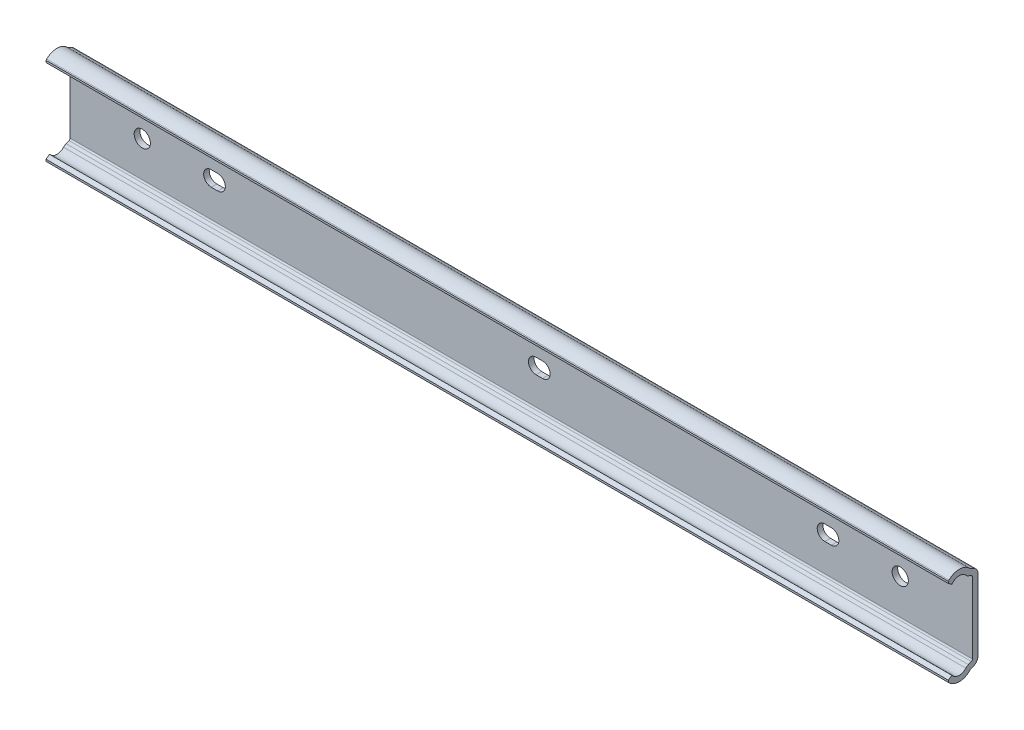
ISO-10303-21;
HEADER;
FILE_DESCRIPTION(('STEP AP214'),'2;1');
FILE_NAME('part.step','',(''),(''),'','','');
FILE_SCHEMA(('AUTOMOTIVE_DESIGN { 1 0 10303 214 1 1 1 1 }'));
ENDSEC;
DATA;
#1=APPLICATION_CONTEXT('core data for automotive mechanical design processes');
#2=APPLICATION_PROTOCOL_DEFINITION('international standard','automotive_design',2000,#1);
#3=PRODUCT_CONTEXT('',#1,'mechanical');
#4=PRODUCT('Part','Part','',(#3));
#5=PRODUCT_RELATED_PRODUCT_CATEGORY('part','',(#4));
#6=PRODUCT_DEFINITION_FORMATION('','',#4);
#7=PRODUCT_DEFINITION_CONTEXT('part definition',#1,'design');
#8=PRODUCT_DEFINITION('design','',#6,#7);
#9=PRODUCT_DEFINITION_SHAPE('','',#8);
#10=(LENGTH_UNIT() NAMED_UNIT(*) SI_UNIT(.MILLI.,.METRE.));
#11=(NAMED_UNIT(*) PLANE_ANGLE_UNIT() SI_UNIT($,.RADIAN.));
#12=(NAMED_UNIT(*) SI_UNIT($,.STERADIAN.) SOLID_ANGLE_UNIT());
#13=UNCERTAINTY_MEASURE_WITH_UNIT(LENGTH_MEASURE(1.E-05),#10,'distance_accuracy_value','');
#14=(GEOMETRIC_REPRESENTATION_CONTEXT(3) GLOBAL_UNCERTAINTY_ASSIGNED_CONTEXT((#13)) GLOBAL_UNIT_ASSIGNED_CONTEXT((#10,
#11,#12)) REPRESENTATION_CONTEXT('',''));
#15=CARTESIAN_POINT('',(0.,0.,0.));
#16=DIRECTION('',(0.,0.,1.));
#17=DIRECTION('',(1.,0.,0.));
#18=AXIS2_PLACEMENT_3D('',#15,#16,#17);
#19=CARTESIAN_POINT('',(-20.,9.85313395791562,1.54999999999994));
#20=DIRECTION('',(0.,0.,1.));
#21=DIRECTION('',(-1.,0.,0.));
#22=AXIS2_PLACEMENT_3D('',#19,#20,#21);
#23=PLANE('',#22);
#24=DIRECTION('',(0.,-1.,0.));
#25=VECTOR('',#24,1.);
#26=CARTESIAN_POINT('',(-20.,9.85313395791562,1.54999999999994));
#27=LINE('',#26,#25);
#28=CARTESIAN_POINT('',(-20.,9.85313395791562,1.54999999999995));
#29=VERTEX_POINT('',#28);
#30=CARTESIAN_POINT('',(-20.,-9.85313395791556,1.54999999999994));
#31=VERTEX_POINT('',#30);
#32=EDGE_CURVE('E510',#29,#31,#27,.T.);
#33=ORIENTED_EDGE('',*,*,#32,.T.);
#34=DIRECTION('',(1.,0.,0.));
#35=VECTOR('',#34,1.);
#36=CARTESIAN_POINT('',(-20.,-9.85313395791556,1.54999999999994));
#37=LINE('',#36,#35);
#38=CARTESIAN_POINT('',(230.,-9.85313395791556,1.54999999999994));
#39=VERTEX_POINT('',#38);
#40=EDGE_CURVE('E524',#31,#39,#37,.T.);
#41=ORIENTED_EDGE('',*,*,#40,.T.);
#42=DIRECTION('',(0.,-1.,0.));
#43=VECTOR('',#42,1.);
#44=CARTESIAN_POINT('',(230.,9.85313395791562,1.54999999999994));
#45=LINE('',#44,#43);
#46=CARTESIAN_POINT('',(230.,9.85313395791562,1.54999999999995));
#47=VERTEX_POINT('',#46);
#48=EDGE_CURVE('E435',#47,#39,#45,.T.);
#49=ORIENTED_EDGE('',*,*,#48,.F.);
#50=DIRECTION('',(1.,0.,0.));
#51=VECTOR('',#50,1.);
#52=CARTESIAN_POINT('',(-20.,9.85313395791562,1.54999999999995));
#53=LINE('',#52,#51);
#54=EDGE_CURVE('E526',#29,#47,#53,.T.);
#55=ORIENTED_EDGE('',*,*,#54,.F.);
#56=EDGE_LOOP('',(#33,#41,#49,#55));
#57=FACE_BOUND('',#56,.T.);
#58=CARTESIAN_POINT('',(20.9,0.,1.54999999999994));
#59=DIRECTION('',(0.,0.,1.));
#60=DIRECTION('',(-1.,0.,0.));
#61=AXIS2_PLACEMENT_3D('',#58,#59,#60);
#62=CIRCLE('',#61,2.1);
#63=CARTESIAN_POINT('',(20.9,-2.09999999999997,1.54999999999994));
#64=VERTEX_POINT('',#63);
#65=CARTESIAN_POINT('',(20.9,2.1,1.54999999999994));
#66=VERTEX_POINT('',#65);
#67=EDGE_CURVE('E31',#64,#66,#62,.T.);
#68=ORIENTED_EDGE('',*,*,#67,.F.);
#69=DIRECTION('',(1.,0.,0.));
#70=VECTOR('',#69,1.);
#71=CARTESIAN_POINT('',(20.9,-2.09999999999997,1.54999999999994));
#72=LINE('',#71,#70);
#73=CARTESIAN_POINT('',(19.1,-2.09999999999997,1.54999999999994));
#74=VERTEX_POINT('',#73);
#75=EDGE_CURVE('E277',#74,#64,#72,.T.);
#76=ORIENTED_EDGE('',*,*,#75,.F.);
#77=CARTESIAN_POINT('',(19.1,0.,1.54999999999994));
#78=DIRECTION('',(0.,0.,1.));
#79=DIRECTION('',(-1.,0.,0.));
#80=AXIS2_PLACEMENT_3D('',#77,#78,#79);
#81=CIRCLE('',#80,2.1);
#82=CARTESIAN_POINT('',(19.1,2.1,1.54999999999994));
#83=VERTEX_POINT('',#82);
#84=EDGE_CURVE('E262',#83,#74,#81,.T.);
#85=ORIENTED_EDGE('',*,*,#84,.F.);
#86=DIRECTION('',(-1.,0.,0.));
#87=VECTOR('',#86,1.);
#88=CARTESIAN_POINT('',(20.9,2.1,1.54999999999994));
#89=LINE('',#88,#87);
#90=EDGE_CURVE('E271',#66,#83,#89,.T.);
#91=ORIENTED_EDGE('',*,*,#90,.F.);
#92=EDGE_LOOP('',(#68,#76,#85,#91));
#93=FACE_BOUND('',#92,.T.);
#94=CARTESIAN_POINT('',(110.9,0.,1.54999999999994));
#95=DIRECTION('',(0.,0.,1.));
#96=DIRECTION('',(-1.,0.,0.));
#97=AXIS2_PLACEMENT_3D('',#94,#95,#96);
#98=CIRCLE('',#97,2.1);
#99=CARTESIAN_POINT('',(110.9,-2.09999999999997,1.54999999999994));
#100=VERTEX_POINT('',#99);
#101=CARTESIAN_POINT('',(110.9,2.10000000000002,1.54999999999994));
#102=VERTEX_POINT('',#101);
#103=EDGE_CURVE('E293',#100,#102,#98,.T.);
#104=ORIENTED_EDGE('',*,*,#103,.F.);
#105=DIRECTION('',(1.,0.,0.));
#106=VECTOR('',#105,1.);
#107=CARTESIAN_POINT('',(110.9,-2.09999999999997,1.54999999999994));
#108=LINE('',#107,#106);
#109=CARTESIAN_POINT('',(109.1,-2.09999999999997,1.54999999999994));
#110=VERTEX_POINT('',#109);
#111=EDGE_CURVE('E303',#110,#100,#108,.T.);
#112=ORIENTED_EDGE('',*,*,#111,.F.);
#113=CARTESIAN_POINT('',(109.1,0.,1.54999999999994));
#114=DIRECTION('',(0.,0.,1.));
#115=DIRECTION('',(-1.,0.,0.));
#116=AXIS2_PLACEMENT_3D('',#113,#114,#115);
#117=CIRCLE('',#116,2.1);
#118=CARTESIAN_POINT('',(109.1,2.10000000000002,1.54999999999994));
#119=VERTEX_POINT('',#118);
#120=EDGE_CURVE('E300',#119,#110,#117,.T.);
#121=ORIENTED_EDGE('',*,*,#120,.F.);
#122=DIRECTION('',(-1.,0.,0.));
#123=VECTOR('',#122,1.);
#124=CARTESIAN_POINT('',(110.9,2.10000000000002,1.54999999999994));
#125=LINE('',#124,#123);
#126=EDGE_CURVE('E297',#102,#119,#125,.T.);
#127=ORIENTED_EDGE('',*,*,#126,.F.);
#128=EDGE_LOOP('',(#104,#112,#121,#127));
#129=FACE_BOUND('',#128,.T.);
#130=CARTESIAN_POINT('',(210.,0.,1.54999999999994));
#131=DIRECTION('',(0.,0.,1.));
#132=DIRECTION('',(-1.,0.,0.));
#133=AXIS2_PLACEMENT_3D('',#130,#131,#132);
#134=CIRCLE('',#133,2.24999999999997);
#135=CARTESIAN_POINT('',(207.75,0.,1.54999999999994));
#136=VERTEX_POINT('',#135);
#137=EDGE_CURVE('E321',#136,#136,#134,.T.);
#138=ORIENTED_EDGE('',*,*,#137,.F.);
#139=EDGE_LOOP('',(#138));
#140=FACE_BOUND('',#139,.T.);
#141=CARTESIAN_POINT('',(0.,0.,1.54999999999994));
#142=DIRECTION('',(0.,0.,1.));
#143=DIRECTION('',(-1.,0.,0.));
#144=AXIS2_PLACEMENT_3D('',#141,#142,#143);
#145=CIRCLE('',#144,2.25);
#146=CARTESIAN_POINT('',(-2.25,0.,1.54999999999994));
#147=VERTEX_POINT('',#146);
#148=EDGE_CURVE('E333',#147,#147,#145,.T.);
#149=ORIENTED_EDGE('',*,*,#148,.F.);
#150=EDGE_LOOP('',(#149));
#151=FACE_BOUND('',#150,.T.);
#152=CARTESIAN_POINT('',(189.1,0.,1.54999999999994));
#153=DIRECTION('',(0.,0.,1.));
#154=DIRECTION('',(-1.,0.,0.));
#155=AXIS2_PLACEMENT_3D('',#152,#153,#154);
#156=CIRCLE('',#155,2.1);
#157=CARTESIAN_POINT('',(189.1,2.10000000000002,1.54999999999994));
#158=VERTEX_POINT('',#157);
#159=CARTESIAN_POINT('',(189.1,-2.09999999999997,1.54999999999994));
#160=VERTEX_POINT('',#159);
#161=EDGE_CURVE('E339',#158,#160,#156,.T.);
#162=ORIENTED_EDGE('',*,*,#161,.F.);
#163=DIRECTION('',(-1.,0.,0.));
#164=VECTOR('',#163,1.);
#165=CARTESIAN_POINT('',(190.9,2.10000000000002,1.54999999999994));
#166=LINE('',#165,#164);
#167=CARTESIAN_POINT('',(190.9,2.10000000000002,1.54999999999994));
#168=VERTEX_POINT('',#167);
#169=EDGE_CURVE('E347',#168,#158,#166,.T.);
#170=ORIENTED_EDGE('',*,*,#169,.F.);
#171=CARTESIAN_POINT('',(190.9,0.,1.54999999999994));
#172=DIRECTION('',(0.,0.,1.));
#173=DIRECTION('',(-1.,0.,0.));
#174=AXIS2_PLACEMENT_3D('',#171,#172,#173);
#175=CIRCLE('',#174,2.1);
#176=CARTESIAN_POINT('',(190.9,-2.09999999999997,1.54999999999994));
#177=VERTEX_POINT('',#176);
#178=EDGE_CURVE('E344',#177,#168,#175,.T.);
#179=ORIENTED_EDGE('',*,*,#178,.F.);
#180=DIRECTION('',(1.,0.,0.));
#181=VECTOR('',#180,1.);
#182=CARTESIAN_POINT('',(190.9,-2.09999999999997,1.54999999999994));
#183=LINE('',#182,#181);
#184=EDGE_CURVE('E341',#160,#177,#183,.T.);
#185=ORIENTED_EDGE('',*,*,#184,.F.);
#186=EDGE_LOOP('',(#162,#170,#179,#185));
#187=FACE_BOUND('',#186,.T.);
#188=ADVANCED_FACE('F14',(#57,#93,#129,#140,#151,#187),#23,.T.);
#189=CARTESIAN_POINT('',(-20.,9.85313395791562,0.));
#190=DIRECTION('',(0.,0.,-1.));
#191=DIRECTION('',(1.,0.,0.));
#192=AXIS2_PLACEMENT_3D('',#189,#190,#191);
#193=PLANE('',#192);
#194=DIRECTION('',(0.,1.,0.));
#195=VECTOR('',#194,1.);
#196=CARTESIAN_POINT('',(-20.,9.85313395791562,0.));
#197=LINE('',#196,#195);
#198=CARTESIAN_POINT('',(-20.,-9.85313395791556,0.));
#199=VERTEX_POINT('',#198);
#200=CARTESIAN_POINT('',(-20.,9.85313395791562,0.));
#201=VERTEX_POINT('',#200);
#202=EDGE_CURVE('E473',#199,#201,#197,.T.);
#203=ORIENTED_EDGE('',*,*,#202,.T.);
#204=DIRECTION('',(1.,0.,0.));
#205=VECTOR('',#204,1.);
#206=CARTESIAN_POINT('',(-20.,9.85313395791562,0.));
#207=LINE('',#206,#205);
#208=CARTESIAN_POINT('',(230.,9.85313395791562,0.));
#209=VERTEX_POINT('',#208);
#210=EDGE_CURVE('E551',#201,#209,#207,.T.);
#211=ORIENTED_EDGE('',*,*,#210,.T.);
#212=DIRECTION('',(0.,1.,0.));
#213=VECTOR('',#212,1.);
#214=CARTESIAN_POINT('',(230.,9.85313395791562,0.));
#215=LINE('',#214,#213);
#216=CARTESIAN_POINT('',(230.,-9.85313395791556,0.));
#217=VERTEX_POINT('',#216);
#218=EDGE_CURVE('E397',#217,#209,#215,.T.);
#219=ORIENTED_EDGE('',*,*,#218,.F.);
#220=DIRECTION('',(1.,0.,0.));
#221=VECTOR('',#220,1.);
#222=CARTESIAN_POINT('',(-20.,-9.85313395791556,0.));
#223=LINE('',#222,#221);
#224=EDGE_CURVE('E553',#199,#217,#223,.T.);
#225=ORIENTED_EDGE('',*,*,#224,.F.);
#226=EDGE_LOOP('',(#203,#211,#219,#225));
#227=FACE_BOUND('',#226,.T.);
#228=CARTESIAN_POINT('',(20.9,0.,0.));
#229=DIRECTION('',(0.,0.,1.));
#230=DIRECTION('',(-1.,0.,0.));
#231=AXIS2_PLACEMENT_3D('',#228,#229,#230);
#232=CIRCLE('',#231,2.1);
#233=CARTESIAN_POINT('',(20.9,-2.09999999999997,0.));
#234=VERTEX_POINT('',#233);
#235=CARTESIAN_POINT('',(20.9,2.1,0.));
#236=VERTEX_POINT('',#235);
#237=EDGE_CURVE('E279',#234,#236,#232,.T.);
#238=ORIENTED_EDGE('',*,*,#237,.T.);
#239=DIRECTION('',(-1.,0.,0.));
#240=VECTOR('',#239,1.);
#241=CARTESIAN_POINT('',(20.9,2.1,0.));
#242=LINE('',#241,#240);
#243=CARTESIAN_POINT('',(19.1,2.1,0.));
#244=VERTEX_POINT('',#243);
#245=EDGE_CURVE('E285',#236,#244,#242,.T.);
#246=ORIENTED_EDGE('',*,*,#245,.T.);
#247=CARTESIAN_POINT('',(19.1,0.,0.));
#248=DIRECTION('',(0.,0.,1.));
#249=DIRECTION('',(-1.,0.,0.));
#250=AXIS2_PLACEMENT_3D('',#247,#248,#249);
#251=CIRCLE('',#250,2.1);
#252=CARTESIAN_POINT('',(19.1,-2.09999999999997,0.));
#253=VERTEX_POINT('',#252);
#254=EDGE_CURVE('E39',#244,#253,#251,.T.);
#255=ORIENTED_EDGE('',*,*,#254,.T.);
#256=DIRECTION('',(1.,0.,0.));
#257=VECTOR('',#256,1.);
#258=CARTESIAN_POINT('',(20.9,-2.09999999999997,0.));
#259=LINE('',#258,#257);
#260=EDGE_CURVE('E288',#253,#234,#259,.T.);
#261=ORIENTED_EDGE('',*,*,#260,.T.);
#262=EDGE_LOOP('',(#238,#246,#255,#261));
#263=FACE_BOUND('',#262,.T.);
#264=CARTESIAN_POINT('',(110.9,0.,0.));
#265=DIRECTION('',(0.,0.,1.));
#266=DIRECTION('',(-1.,0.,0.));
#267=AXIS2_PLACEMENT_3D('',#264,#265,#266);
#268=CIRCLE('',#267,2.1);
#269=CARTESIAN_POINT('',(110.9,-2.09999999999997,0.));
#270=VERTEX_POINT('',#269);
#271=CARTESIAN_POINT('',(110.9,2.10000000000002,0.));
#272=VERTEX_POINT('',#271);
#273=EDGE_CURVE('E306',#270,#272,#268,.T.);
#274=ORIENTED_EDGE('',*,*,#273,.T.);
#275=DIRECTION('',(-1.,0.,0.));
#276=VECTOR('',#275,1.);
#277=CARTESIAN_POINT('',(110.9,2.10000000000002,0.));
#278=LINE('',#277,#276);
#279=CARTESIAN_POINT('',(109.1,2.10000000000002,0.));
#280=VERTEX_POINT('',#279);
#281=EDGE_CURVE('E309',#272,#280,#278,.T.);
#282=ORIENTED_EDGE('',*,*,#281,.T.);
#283=CARTESIAN_POINT('',(109.1,0.,0.));
#284=DIRECTION('',(0.,0.,1.));
#285=DIRECTION('',(-1.,0.,0.));
#286=AXIS2_PLACEMENT_3D('',#283,#284,#285);
#287=CIRCLE('',#286,2.1);
#288=CARTESIAN_POINT('',(109.1,-2.09999999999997,0.));
#289=VERTEX_POINT('',#288);
#290=EDGE_CURVE('E312',#280,#289,#287,.T.);
#291=ORIENTED_EDGE('',*,*,#290,.T.);
#292=DIRECTION('',(1.,0.,0.));
#293=VECTOR('',#292,1.);
#294=CARTESIAN_POINT('',(110.9,-2.09999999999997,0.));
#295=LINE('',#294,#293);
#296=EDGE_CURVE('E315',#289,#270,#295,.T.);
#297=ORIENTED_EDGE('',*,*,#296,.T.);
#298=EDGE_LOOP('',(#274,#282,#291,#297));
#299=FACE_BOUND('',#298,.T.);
#300=CARTESIAN_POINT('',(210.,0.,0.));
#301=DIRECTION('',(0.,0.,1.));
#302=DIRECTION('',(-1.,0.,0.));
#303=AXIS2_PLACEMENT_3D('',#300,#301,#302);
#304=CIRCLE('',#303,2.24999999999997);
#305=CARTESIAN_POINT('',(207.75,0.,0.));
#306=VERTEX_POINT('',#305);
#307=EDGE_CURVE('E330',#306,#306,#304,.T.);
#308=ORIENTED_EDGE('',*,*,#307,.T.);
#309=EDGE_LOOP('',(#308));
#310=FACE_BOUND('',#309,.T.);
#311=CARTESIAN_POINT('',(0.,0.,0.));
#312=DIRECTION('',(0.,0.,1.));
#313=DIRECTION('',(-1.,0.,0.));
#314=AXIS2_PLACEMENT_3D('',#311,#312,#313);
#315=CIRCLE('',#314,2.25);
#316=CARTESIAN_POINT('',(-2.25,0.,0.));
#317=VERTEX_POINT('',#316);
#318=EDGE_CURVE('E336',#317,#317,#315,.T.);
#319=ORIENTED_EDGE('',*,*,#318,.T.);
#320=EDGE_LOOP('',(#319));
#321=FACE_BOUND('',#320,.T.);
#322=CARTESIAN_POINT('',(189.1,0.,0.));
#323=DIRECTION('',(0.,0.,1.));
#324=DIRECTION('',(-1.,0.,0.));
#325=AXIS2_PLACEMENT_3D('',#322,#323,#324);
#326=CIRCLE('',#325,2.1);
#327=CARTESIAN_POINT('',(189.1,2.10000000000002,0.));
#328=VERTEX_POINT('',#327);
#329=CARTESIAN_POINT('',(189.1,-2.09999999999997,0.));
#330=VERTEX_POINT('',#329);
#331=EDGE_CURVE('E350',#328,#330,#326,.T.);
#332=ORIENTED_EDGE('',*,*,#331,.T.);
#333=DIRECTION('',(1.,0.,0.));
#334=VECTOR('',#333,1.);
#335=CARTESIAN_POINT('',(190.9,-2.09999999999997,0.));
#336=LINE('',#335,#334);
#337=CARTESIAN_POINT('',(190.9,-2.09999999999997,0.));
#338=VERTEX_POINT('',#337);
#339=EDGE_CURVE('E353',#330,#338,#336,.T.);
#340=ORIENTED_EDGE('',*,*,#339,.T.);
#341=CARTESIAN_POINT('',(190.9,0.,0.));
#342=DIRECTION('',(0.,0.,1.));
#343=DIRECTION('',(-1.,0.,0.));
#344=AXIS2_PLACEMENT_3D('',#341,#342,#343);
#345=CIRCLE('',#344,2.1);
#346=CARTESIAN_POINT('',(190.9,2.10000000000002,0.));
#347=VERTEX_POINT('',#346);
#348=EDGE_CURVE('E356',#338,#347,#345,.T.);
#349=ORIENTED_EDGE('',*,*,#348,.T.);
#350=DIRECTION('',(-1.,0.,0.));
#351=VECTOR('',#350,1.);
#352=CARTESIAN_POINT('',(190.9,2.10000000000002,0.));
#353=LINE('',#352,#351);
#354=EDGE_CURVE('E359',#347,#328,#353,.T.);
#355=ORIENTED_EDGE('',*,*,#354,.T.);
#356=EDGE_LOOP('',(#332,#340,#349,#355));
#357=FACE_BOUND('',#356,.T.);
#358=ADVANCED_FACE('F618',(#227,#263,#299,#310,#321,#357),#193,.T.);
#359=CARTESIAN_POINT('',(-20.,-9.46999976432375,5.19000022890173));
#360=DIRECTION('',(1.,0.,0.));
#361=DIRECTION('',(0.,0.,1.));
#362=AXIS2_PLACEMENT_3D('',#359,#360,#361);
#363=CYLINDRICAL_SURFACE('',#362,2.47999999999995);
#364=CARTESIAN_POINT('',(230.,-9.46999976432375,5.19000022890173));
#365=DIRECTION('',(-1.,0.,0.));
#366=DIRECTION('',(0.,0.,1.));
#367=AXIS2_PLACEMENT_3D('',#364,#365,#366);
#368=CIRCLE('',#367,2.47999999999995);
#369=CARTESIAN_POINT('',(230.,-11.1527317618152,3.3682392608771));
#370=VERTEX_POINT('',#369);
#371=CARTESIAN_POINT('',(230.,-11.2236245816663,6.94362504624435));
#372=VERTEX_POINT('',#371);
#373=EDGE_CURVE('E365',#370,#372,#368,.T.);
#374=ORIENTED_EDGE('',*,*,#373,.F.);
#375=DIRECTION('',(1.,0.,0.));
#376=VECTOR('',#375,1.);
#377=CARTESIAN_POINT('',(-20.,-11.1527317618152,3.3682392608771));
#378=LINE('',#377,#376);
#379=CARTESIAN_POINT('',(-20.,-11.1527317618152,3.3682392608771));
#380=VERTEX_POINT('',#379);
#381=EDGE_CURVE('E9',#380,#370,#378,.T.);
#382=ORIENTED_EDGE('',*,*,#381,.F.);
#383=CARTESIAN_POINT('',(-20.,-9.46999976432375,5.19000022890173));
#384=DIRECTION('',(-1.,0.,0.));
#385=DIRECTION('',(0.,0.,1.));
#386=AXIS2_PLACEMENT_3D('',#383,#384,#385);
#387=CIRCLE('',#386,2.47999999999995);
#388=CARTESIAN_POINT('',(-20.,-11.2236245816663,6.94362504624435));
#389=VERTEX_POINT('',#388);
#390=EDGE_CURVE('E447',#380,#389,#387,.T.);
#391=ORIENTED_EDGE('',*,*,#390,.T.);
#392=DIRECTION('',(1.,0.,0.));
#393=VECTOR('',#392,1.);
#394=CARTESIAN_POINT('',(-20.,-11.2236245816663,6.94362504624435));
#395=LINE('',#394,#393);
#396=EDGE_CURVE('E18',#389,#372,#395,.T.);
#397=ORIENTED_EDGE('',*,*,#396,.T.);
#398=EDGE_LOOP('',(#374,#382,#391,#397));
#399=FACE_BOUND('',#398,.T.);
#400=ADVANCED_FACE('F16',(#399),#363,.F.);
#401=CARTESIAN_POINT('',(-20.,-12.5436997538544,1.86234824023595));
#402=DIRECTION('',(1.,0.,0.));
#403=DIRECTION('',(0.,0.,1.));
#404=AXIS2_PLACEMENT_3D('',#401,#402,#403);
#405=CYLINDRICAL_SURFACE('',#404,2.04999993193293);
#406=CARTESIAN_POINT('',(230.,-12.5436997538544,1.86234824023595));
#407=DIRECTION('',(1.,0.,0.));
#408=DIRECTION('',(0.,0.,1.));
#409=AXIS2_PLACEMENT_3D('',#406,#407,#408);
#410=CIRCLE('',#409,2.04999993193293);
#411=CARTESIAN_POINT('',(230.,-10.6566648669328,2.66334702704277));
#412=VERTEX_POINT('',#411);
#413=EDGE_CURVE('E444',#412,#370,#410,.T.);
#414=ORIENTED_EDGE('',*,*,#413,.F.);
#415=DIRECTION('',(1.,0.,0.));
#416=VECTOR('',#415,1.);
#417=CARTESIAN_POINT('',(-20.,-10.6566648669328,2.66334702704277));
#418=LINE('',#417,#416);
#419=CARTESIAN_POINT('',(-20.,-10.6566648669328,2.66334702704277));
#420=VERTEX_POINT('',#419);
#421=EDGE_CURVE('E23',#420,#412,#418,.T.);
#422=ORIENTED_EDGE('',*,*,#421,.F.);
#423=CARTESIAN_POINT('',(-20.,-12.5436997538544,1.86234824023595));
#424=DIRECTION('',(1.,0.,0.));
#425=DIRECTION('',(0.,0.,1.));
#426=AXIS2_PLACEMENT_3D('',#423,#424,#425);
#427=CIRCLE('',#426,2.04999993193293);
#428=EDGE_CURVE('E518',#420,#380,#427,.T.);
#429=ORIENTED_EDGE('',*,*,#428,.T.);
#430=ORIENTED_EDGE('',*,*,#381,.T.);
#431=EDGE_LOOP('',(#414,#422,#429,#430));
#432=FACE_BOUND('',#431,.T.);
#433=ADVANCED_FACE('F581',(#432),#405,.T.);
#434=CARTESIAN_POINT('',(-20.,-10.6566648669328,2.66334702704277));
#435=DIRECTION('',(0.,0.920504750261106,0.390731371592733));
#436=DIRECTION('',(0.,-0.390731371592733,0.920504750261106));
#437=AXIS2_PLACEMENT_3D('',#434,#435,#436);
#438=PLANE('',#437);
#439=DIRECTION('',(0.,-0.390731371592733,0.920504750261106));
#440=VECTOR('',#439,1.);
#441=CARTESIAN_POINT('',(230.,-10.6566648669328,2.66334702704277));
#442=LINE('',#441,#440);
#443=CARTESIAN_POINT('',(230.,-10.3133868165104,1.85463521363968));
#444=VERTEX_POINT('',#443);
#445=EDGE_CURVE('E441',#444,#412,#442,.T.);
#446=ORIENTED_EDGE('',*,*,#445,.F.);
#447=DIRECTION('',(1.,0.,0.));
#448=VECTOR('',#447,1.);
#449=CARTESIAN_POINT('',(-20.,-10.3133868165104,1.85463521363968));
#450=LINE('',#449,#448);
#451=CARTESIAN_POINT('',(-20.,-10.3133868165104,1.85463521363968));
#452=VERTEX_POINT('',#451);
#453=EDGE_CURVE('E522',#452,#444,#450,.T.);
#454=ORIENTED_EDGE('',*,*,#453,.F.);
#455=DIRECTION('',(0.,-0.390731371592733,0.920504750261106));
#456=VECTOR('',#455,1.);
#457=CARTESIAN_POINT('',(-20.,-10.6566648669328,2.66334702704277));
#458=LINE('',#457,#456);
#459=EDGE_CURVE('E515',#452,#420,#458,.T.);
#460=ORIENTED_EDGE('',*,*,#459,.T.);
#461=ORIENTED_EDGE('',*,*,#421,.T.);
#462=EDGE_LOOP('',(#446,#454,#460,#461));
#463=FACE_BOUND('',#462,.T.);
#464=ADVANCED_FACE('F678',(#463),#438,.T.);
#465=CARTESIAN_POINT('',(-20.,-9.85313395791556,2.05000015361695));
#466=DIRECTION('',(1.,0.,0.));
#467=DIRECTION('',(0.,0.,1.));
#468=AXIS2_PLACEMENT_3D('',#465,#466,#467);
#469=CYLINDRICAL_SURFACE('',#468,0.500000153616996);
#470=CARTESIAN_POINT('',(230.,-9.85313395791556,2.05000015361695));
#471=DIRECTION('',(-1.,0.,0.));
#472=DIRECTION('',(0.,0.,1.));
#473=AXIS2_PLACEMENT_3D('',#470,#471,#472);
#474=CIRCLE('',#473,0.500000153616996);
#475=EDGE_CURVE('E438',#39,#444,#474,.T.);
#476=ORIENTED_EDGE('',*,*,#475,.F.);
#477=ORIENTED_EDGE('',*,*,#40,.F.);
#478=CARTESIAN_POINT('',(-20.,-9.85313395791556,2.05000015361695));
#479=DIRECTION('',(-1.,0.,0.));
#480=DIRECTION('',(0.,0.,1.));
#481=AXIS2_PLACEMENT_3D('',#478,#479,#480);
#482=CIRCLE('',#481,0.500000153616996);
#483=EDGE_CURVE('E512',#31,#452,#482,.T.);
#484=ORIENTED_EDGE('',*,*,#483,.T.);
#485=ORIENTED_EDGE('',*,*,#453,.T.);
#486=EDGE_LOOP('',(#476,#477,#484,#485));
#487=FACE_BOUND('',#486,.T.);
#488=ADVANCED_FACE('F676',(#487),#469,.F.);
#489=CARTESIAN_POINT('',(-20.,9.85313395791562,2.05000015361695));
#490=DIRECTION('',(1.,0.,0.));
#491=DIRECTION('',(0.,0.,1.));
#492=AXIS2_PLACEMENT_3D('',#489,#490,#491);
#493=CYLINDRICAL_SURFACE('',#492,0.500000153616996);
#494=CARTESIAN_POINT('',(230.,9.85313395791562,2.05000015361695));
#495=DIRECTION('',(-1.,0.,0.));
#496=DIRECTION('',(0.,0.,-1.));
#497=AXIS2_PLACEMENT_3D('',#494,#495,#496);
#498=CIRCLE('',#497,0.500000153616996);
#499=CARTESIAN_POINT('',(230.,10.3133868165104,1.85463521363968));
#500=VERTEX_POINT('',#499);
#501=EDGE_CURVE('E432',#500,#47,#498,.T.);
#502=ORIENTED_EDGE('',*,*,#501,.F.);
#503=DIRECTION('',(1.,0.,0.));
#504=VECTOR('',#503,1.);
#505=CARTESIAN_POINT('',(-20.,10.3133868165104,1.85463521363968));
#506=LINE('',#505,#504);
#507=CARTESIAN_POINT('',(-20.,10.3133868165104,1.85463521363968));
#508=VERTEX_POINT('',#507);
#509=EDGE_CURVE('E528',#508,#500,#506,.T.);
#510=ORIENTED_EDGE('',*,*,#509,.F.);
#511=CARTESIAN_POINT('',(-20.,9.85313395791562,2.05000015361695));
#512=DIRECTION('',(-1.,0.,0.));
#513=DIRECTION('',(0.,0.,-1.));
#514=AXIS2_PLACEMENT_3D('',#511,#512,#513);
#515=CIRCLE('',#514,0.500000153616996);
#516=EDGE_CURVE('E507',#508,#29,#515,.T.);
#517=ORIENTED_EDGE('',*,*,#516,.T.);
#518=ORIENTED_EDGE('',*,*,#54,.T.);
#519=EDGE_LOOP('',(#502,#510,#517,#518));
#520=FACE_BOUND('',#519,.T.);
#521=ADVANCED_FACE('F668',(#520),#493,.F.);
#522=CARTESIAN_POINT('',(-20.,10.6566648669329,2.66334702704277));
#523=DIRECTION('',(0.,-0.920504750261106,0.390731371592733));
#524=DIRECTION('',(0.,-0.390731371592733,-0.920504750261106));
#525=AXIS2_PLACEMENT_3D('',#522,#523,#524);
#526=PLANE('',#525);
#527=DIRECTION('',(0.,-0.390731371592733,-0.920504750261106));
#528=VECTOR('',#527,1.);
#529=CARTESIAN_POINT('',(230.,10.6566648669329,2.66334702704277));
#530=LINE('',#529,#528);
#531=CARTESIAN_POINT('',(230.,10.6566648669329,2.66334702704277));
#532=VERTEX_POINT('',#531);
#533=EDGE_CURVE('E429',#532,#500,#530,.T.);
#534=ORIENTED_EDGE('',*,*,#533,.F.);
#535=DIRECTION('',(1.,0.,0.));
#536=VECTOR('',#535,1.);
#537=CARTESIAN_POINT('',(-20.,10.6566648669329,2.66334702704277));
#538=LINE('',#537,#536);
#539=CARTESIAN_POINT('',(-20.,10.6566648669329,2.66334702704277));
#540=VERTEX_POINT('',#539);
#541=EDGE_CURVE('E530',#540,#532,#538,.T.);
#542=ORIENTED_EDGE('',*,*,#541,.F.);
#543=DIRECTION('',(0.,-0.390731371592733,-0.920504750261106));
#544=VECTOR('',#543,1.);
#545=CARTESIAN_POINT('',(-20.,10.6566648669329,2.66334702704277));
#546=LINE('',#545,#544);
#547=EDGE_CURVE('E504',#540,#508,#546,.T.);
#548=ORIENTED_EDGE('',*,*,#547,.T.);
#549=ORIENTED_EDGE('',*,*,#509,.T.);
#550=EDGE_LOOP('',(#534,#542,#548,#549));
#551=FACE_BOUND('',#550,.T.);
#552=ADVANCED_FACE('F664',(#551),#526,.T.);
#553=CARTESIAN_POINT('',(-20.,12.5436997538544,1.86234824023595));
#554=DIRECTION('',(1.,0.,0.));
#555=DIRECTION('',(0.,0.,1.));
#556=AXIS2_PLACEMENT_3D('',#553,#554,#555);
#557=CYLINDRICAL_SURFACE('',#556,2.04999993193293);
#558=CARTESIAN_POINT('',(230.,12.5436997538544,1.86234824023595));
#559=DIRECTION('',(1.,0.,0.));
#560=DIRECTION('',(0.,0.,-1.));
#561=AXIS2_PLACEMENT_3D('',#558,#559,#560);
#562=CIRCLE('',#561,2.04999993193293);
#563=CARTESIAN_POINT('',(230.,11.1527317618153,3.36823926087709));
#564=VERTEX_POINT('',#563);
#565=EDGE_CURVE('E426',#564,#532,#562,.T.);
#566=ORIENTED_EDGE('',*,*,#565,.F.);
#567=DIRECTION('',(1.,0.,0.));
#568=VECTOR('',#567,1.);
#569=CARTESIAN_POINT('',(-20.,11.1527317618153,3.36823926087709));
#570=LINE('',#569,#568);
#571=CARTESIAN_POINT('',(-20.,11.1527317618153,3.36823926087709));
#572=VERTEX_POINT('',#571);
#573=EDGE_CURVE('E532',#572,#564,#570,.T.);
#574=ORIENTED_EDGE('',*,*,#573,.F.);
#575=CARTESIAN_POINT('',(-20.,12.5436997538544,1.86234824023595));
#576=DIRECTION('',(1.,0.,0.));
#577=DIRECTION('',(0.,0.,-1.));
#578=AXIS2_PLACEMENT_3D('',#575,#576,#577);
#579=CIRCLE('',#578,2.04999993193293);
#580=EDGE_CURVE('E501',#572,#540,#579,.T.);
#581=ORIENTED_EDGE('',*,*,#580,.T.);
#582=ORIENTED_EDGE('',*,*,#541,.T.);
#583=EDGE_LOOP('',(#566,#574,#581,#582));
#584=FACE_BOUND('',#583,.T.);
#585=ADVANCED_FACE('F660',(#584),#557,.T.);
#586=CARTESIAN_POINT('',(-20.,9.46999976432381,5.19000022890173));
#587=DIRECTION('',(1.,0.,0.));
#588=DIRECTION('',(0.,0.,1.));
#589=AXIS2_PLACEMENT_3D('',#586,#587,#588);
#590=CYLINDRICAL_SURFACE('',#589,2.47999999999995);
#591=CARTESIAN_POINT('',(230.,9.46999976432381,5.19000022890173));
#592=DIRECTION('',(-1.,0.,0.));
#593=DIRECTION('',(0.,0.,-1.));
#594=AXIS2_PLACEMENT_3D('',#591,#592,#593);
#595=CIRCLE('',#594,2.47999999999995);
#596=CARTESIAN_POINT('',(230.,11.2236245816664,6.94362504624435));
#597=VERTEX_POINT('',#596);
#598=EDGE_CURVE('E423',#597,#564,#595,.T.);
#599=ORIENTED_EDGE('',*,*,#598,.F.);
#600=DIRECTION('',(1.,0.,0.));
#601=VECTOR('',#600,1.);
#602=CARTESIAN_POINT('',(-20.,11.2236245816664,6.94362504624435));
#603=LINE('',#602,#601);
#604=CARTESIAN_POINT('',(-20.,11.2236245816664,6.94362504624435));
#605=VERTEX_POINT('',#604);
#606=EDGE_CURVE('E534',#605,#597,#603,.T.);
#607=ORIENTED_EDGE('',*,*,#606,.F.);
#608=CARTESIAN_POINT('',(-20.,9.46999976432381,5.19000022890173));
#609=DIRECTION('',(-1.,0.,0.));
#610=DIRECTION('',(0.,0.,-1.));
#611=AXIS2_PLACEMENT_3D('',#608,#609,#610);
#612=CIRCLE('',#611,2.47999999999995);
#613=EDGE_CURVE('E498',#605,#572,#612,.T.);
#614=ORIENTED_EDGE('',*,*,#613,.T.);
#615=ORIENTED_EDGE('',*,*,#573,.T.);
#616=EDGE_LOOP('',(#599,#607,#614,#615));
#617=FACE_BOUND('',#616,.T.);
#618=ADVANCED_FACE('F656',(#617),#590,.F.);
#619=CARTESIAN_POINT('',(-20.,11.2236245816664,6.94362504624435));
#620=DIRECTION('',(0.,-0.707107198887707,-0.707106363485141));
#621=DIRECTION('',(0.,0.707106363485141,-0.707107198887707));
#622=AXIS2_PLACEMENT_3D('',#619,#620,#621);
#623=PLANE('',#622);
#624=DIRECTION('',(0.,0.707106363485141,-0.707107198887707));
#625=VECTOR('',#624,1.);
#626=CARTESIAN_POINT('',(230.,11.2236245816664,6.94362504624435));
#627=LINE('',#626,#625);
#628=CARTESIAN_POINT('',(230.,10.9144127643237,7.25283722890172));
#629=VERTEX_POINT('',#628);
#630=EDGE_CURVE('E420',#629,#597,#627,.T.);
#631=ORIENTED_EDGE('',*,*,#630,.F.);
#632=DIRECTION('',(1.,0.,0.));
#633=VECTOR('',#632,1.);
#634=CARTESIAN_POINT('',(-20.,10.9144127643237,7.25283722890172));
#635=LINE('',#634,#633);
#636=CARTESIAN_POINT('',(-20.,10.9144127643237,7.25283722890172));
#637=VERTEX_POINT('',#636);
#638=EDGE_CURVE('E536',#637,#629,#635,.T.);
#639=ORIENTED_EDGE('',*,*,#638,.F.);
#640=DIRECTION('',(0.,0.707106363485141,-0.707107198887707));
#641=VECTOR('',#640,1.);
#642=CARTESIAN_POINT('',(-20.,11.2236245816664,6.94362504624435));
#643=LINE('',#642,#641);
#644=EDGE_CURVE('E495',#637,#605,#643,.T.);
#645=ORIENTED_EDGE('',*,*,#644,.T.);
#646=ORIENTED_EDGE('',*,*,#606,.T.);
#647=EDGE_LOOP('',(#631,#639,#645,#646));
#648=FACE_BOUND('',#647,.T.);
#649=ADVANCED_FACE('F652',(#648),#623,.T.);
#650=CARTESIAN_POINT('',(-20.,10.9144127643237,7.25283722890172));
#651=DIRECTION('',(0.,-0.819151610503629,0.573577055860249));
#652=DIRECTION('',(0.,-0.573577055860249,-0.819151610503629));
#653=AXIS2_PLACEMENT_3D('',#650,#651,#652);
#654=PLANE('',#653);
#655=DIRECTION('',(0.,-0.573577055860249,-0.819151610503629));
#656=VECTOR('',#655,1.);
#657=CARTESIAN_POINT('',(230.,10.9144127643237,7.25283722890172));
#658=LINE('',#657,#656);
#659=CARTESIAN_POINT('',(230.,11.5986307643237,8.23000022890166));
#660=VERTEX_POINT('',#659);
#661=EDGE_CURVE('E417',#660,#629,#658,.T.);
#662=ORIENTED_EDGE('',*,*,#661,.F.);
#663=DIRECTION('',(1.,0.,0.));
#664=VECTOR('',#663,1.);
#665=CARTESIAN_POINT('',(-20.,11.5986307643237,8.23000022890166));
#666=LINE('',#665,#664);
#667=CARTESIAN_POINT('',(-20.,11.5986307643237,8.23000022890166));
#668=VERTEX_POINT('',#667);
#669=EDGE_CURVE('E538',#668,#660,#666,.T.);
#670=ORIENTED_EDGE('',*,*,#669,.F.);
#671=DIRECTION('',(0.,-0.573577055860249,-0.819151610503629));
#672=VECTOR('',#671,1.);
#673=CARTESIAN_POINT('',(-20.,10.9144127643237,7.25283722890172));
#674=LINE('',#673,#672);
#675=EDGE_CURVE('E492',#668,#637,#674,.T.);
#676=ORIENTED_EDGE('',*,*,#675,.T.);
#677=ORIENTED_EDGE('',*,*,#638,.T.);
#678=EDGE_LOOP('',(#662,#670,#676,#677));
#679=FACE_BOUND('',#678,.T.);
#680=ADVANCED_FACE('F648',(#679),#654,.T.);
#681=CARTESIAN_POINT('',(-20.,12.1292794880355,8.22999995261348));
#682=DIRECTION('',(0.,5.20661172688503E-07,0.999999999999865));
#683=DIRECTION('',(0.,-0.999999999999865,5.20661172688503E-07));
#684=AXIS2_PLACEMENT_3D('',#681,#682,#683);
#685=PLANE('',#684);
#686=DIRECTION('',(0.,-0.999999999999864,5.20661172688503E-07));
#687=VECTOR('',#686,1.);
#688=CARTESIAN_POINT('',(230.,12.1292794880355,8.22999995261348));
#689=LINE('',#688,#687);
#690=CARTESIAN_POINT('',(230.,12.1292794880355,8.22999995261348));
#691=VERTEX_POINT('',#690);
#692=EDGE_CURVE('E414',#691,#660,#689,.T.);
#693=ORIENTED_EDGE('',*,*,#692,.F.);
#694=DIRECTION('',(1.,0.,0.));
#695=VECTOR('',#694,1.);
#696=CARTESIAN_POINT('',(-20.,12.1292794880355,8.22999995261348));
#697=LINE('',#696,#695);
#698=CARTESIAN_POINT('',(-20.,12.1292794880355,8.22999995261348));
#699=VERTEX_POINT('',#698);
#700=EDGE_CURVE('E540',#699,#691,#697,.T.);
#701=ORIENTED_EDGE('',*,*,#700,.F.);
#702=DIRECTION('',(0.,-0.999999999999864,5.20661172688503E-07));
#703=VECTOR('',#702,1.);
#704=CARTESIAN_POINT('',(-20.,12.1292794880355,8.22999995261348));
#705=LINE('',#704,#703);
#706=EDGE_CURVE('E489',#699,#668,#705,.T.);
#707=ORIENTED_EDGE('',*,*,#706,.T.);
#708=ORIENTED_EDGE('',*,*,#669,.T.);
#709=EDGE_LOOP('',(#693,#701,#707,#708));
#710=FACE_BOUND('',#709,.T.);
#711=ADVANCED_FACE('F644',(#710),#685,.T.);
#712=CARTESIAN_POINT('',(-20.,12.3196398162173,8.03964028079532));
#713=DIRECTION('',(0.,0.70710556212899,0.707108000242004));
#714=DIRECTION('',(0.,-0.707108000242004,0.70710556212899));
#715=AXIS2_PLACEMENT_3D('',#712,#713,#714);
#716=PLANE('',#715);
#717=DIRECTION('',(0.,-0.707108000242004,0.70710556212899));
#718=VECTOR('',#717,1.);
#719=CARTESIAN_POINT('',(230.,12.3196398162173,8.03964028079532));
#720=LINE('',#719,#718);
#721=CARTESIAN_POINT('',(230.,12.3196398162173,8.03964028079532));
#722=VERTEX_POINT('',#721);
#723=EDGE_CURVE('E411',#722,#691,#720,.T.);
#724=ORIENTED_EDGE('',*,*,#723,.F.);
#725=DIRECTION('',(1.,0.,0.));
#726=VECTOR('',#725,1.);
#727=CARTESIAN_POINT('',(-20.,12.3196398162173,8.03964028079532));
#728=LINE('',#727,#726);
#729=CARTESIAN_POINT('',(-20.,12.3196398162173,8.03964028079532));
#730=VERTEX_POINT('',#729);
#731=EDGE_CURVE('E542',#730,#722,#728,.T.);
#732=ORIENTED_EDGE('',*,*,#731,.F.);
#733=DIRECTION('',(0.,-0.707108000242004,0.70710556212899));
#734=VECTOR('',#733,1.);
#735=CARTESIAN_POINT('',(-20.,12.3196398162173,8.03964028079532));
#736=LINE('',#735,#734);
#737=EDGE_CURVE('E486',#730,#699,#736,.T.);
#738=ORIENTED_EDGE('',*,*,#737,.T.);
#739=ORIENTED_EDGE('',*,*,#700,.T.);
#740=EDGE_LOOP('',(#724,#732,#738,#739));
#741=FACE_BOUND('',#740,.T.);
#742=ADVANCED_FACE('F640',(#741),#716,.T.);
#743=CARTESIAN_POINT('',(-20.,9.46999976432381,5.19000022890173));
#744=DIRECTION('',(1.,0.,0.));
#745=DIRECTION('',(0.,0.,1.));
#746=AXIS2_PLACEMENT_3D('',#743,#744,#745);
#747=CYLINDRICAL_SURFACE('',#746,4.02999960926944);
#748=CARTESIAN_POINT('',(230.,9.46999976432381,5.19000022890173));
#749=DIRECTION('',(1.,0.,0.));
#750=DIRECTION('',(0.,0.,-1.));
#751=AXIS2_PLACEMENT_3D('',#748,#749,#750);
#752=CIRCLE('',#751,4.02999960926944);
#753=CARTESIAN_POINT('',(230.,12.2044389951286,2.22963894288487));
#754=VERTEX_POINT('',#753);
#755=EDGE_CURVE('E408',#754,#722,#752,.T.);
#756=ORIENTED_EDGE('',*,*,#755,.F.);
#757=DIRECTION('',(1.,0.,0.));
#758=VECTOR('',#757,1.);
#759=CARTESIAN_POINT('',(-20.,12.2044389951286,2.22963894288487));
#760=LINE('',#759,#758);
#761=CARTESIAN_POINT('',(-20.,12.2044389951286,2.22963894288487));
#762=VERTEX_POINT('',#761);
#763=EDGE_CURVE('E544',#762,#754,#760,.T.);
#764=ORIENTED_EDGE('',*,*,#763,.F.);
#765=CARTESIAN_POINT('',(-20.,9.46999976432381,5.19000022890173));
#766=DIRECTION('',(1.,0.,0.));
#767=DIRECTION('',(0.,0.,-1.));
#768=AXIS2_PLACEMENT_3D('',#765,#766,#767);
#769=CIRCLE('',#768,4.02999960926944);
#770=EDGE_CURVE('E483',#762,#730,#769,.T.);
#771=ORIENTED_EDGE('',*,*,#770,.T.);
#772=ORIENTED_EDGE('',*,*,#731,.T.);
#773=EDGE_LOOP('',(#756,#764,#771,#772));
#774=FACE_BOUND('',#773,.T.);
#775=ADVANCED_FACE('F636',(#774),#747,.T.);
#776=CARTESIAN_POINT('',(-20.,12.5436997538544,1.86234824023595));
#777=DIRECTION('',(1.,0.,0.));
#778=DIRECTION('',(0.,0.,1.));
#779=AXIS2_PLACEMENT_3D('',#776,#777,#778);
#780=CYLINDRICAL_SURFACE('',#779,0.500000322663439);
#781=CARTESIAN_POINT('',(230.,12.5436997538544,1.86234824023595));
#782=DIRECTION('',(-1.,0.,0.));
#783=DIRECTION('',(0.,0.,-1.));
#784=AXIS2_PLACEMENT_3D('',#781,#782,#783);
#785=CIRCLE('',#784,0.500000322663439);
#786=CARTESIAN_POINT('',(230.,12.0834470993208,2.05771409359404));
#787=VERTEX_POINT('',#786);
#788=EDGE_CURVE('E405',#787,#754,#785,.T.);
#789=ORIENTED_EDGE('',*,*,#788,.F.);
#790=DIRECTION('',(1.,0.,0.));
#791=VECTOR('',#790,1.);
#792=CARTESIAN_POINT('',(-20.,12.0834470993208,2.05771409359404));
#793=LINE('',#792,#791);
#794=CARTESIAN_POINT('',(-20.,12.0834470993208,2.05771409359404));
#795=VERTEX_POINT('',#794);
#796=EDGE_CURVE('E546',#795,#787,#793,.T.);
#797=ORIENTED_EDGE('',*,*,#796,.F.);
#798=CARTESIAN_POINT('',(-20.,12.5436997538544,1.86234824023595));
#799=DIRECTION('',(-1.,0.,0.));
#800=DIRECTION('',(0.,0.,-1.));
#801=AXIS2_PLACEMENT_3D('',#798,#799,#800);
#802=CIRCLE('',#801,0.500000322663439);
#803=EDGE_CURVE('E480',#795,#762,#802,.T.);
#804=ORIENTED_EDGE('',*,*,#803,.T.);
#805=ORIENTED_EDGE('',*,*,#763,.T.);
#806=EDGE_LOOP('',(#789,#797,#804,#805));
#807=FACE_BOUND('',#806,.T.);
#808=ADVANCED_FACE('F633',(#807),#780,.F.);
#809=CARTESIAN_POINT('',(-20.,12.0834470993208,2.05771409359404));
#810=DIRECTION('',(0.,0.920504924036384,-0.390730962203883));
#811=DIRECTION('',(0.,0.390730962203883,0.920504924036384));
#812=AXIS2_PLACEMENT_3D('',#809,#810,#811);
#813=PLANE('',#812);
#814=DIRECTION('',(0.,0.390730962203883,0.920504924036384));
#815=VECTOR('',#814,1.);
#816=CARTESIAN_POINT('',(230.,12.0834470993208,2.05771409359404));
#817=LINE('',#816,#815);
#818=CARTESIAN_POINT('',(230.,11.7401690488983,1.24900128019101));
#819=VERTEX_POINT('',#818);
#820=EDGE_CURVE('E403',#819,#787,#817,.T.);
#821=ORIENTED_EDGE('',*,*,#820,.F.);
#822=DIRECTION('',(1.,0.,0.));
#823=VECTOR('',#822,1.);
#824=CARTESIAN_POINT('',(-20.,11.7401690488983,1.24900128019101));
#825=LINE('',#824,#823);
#826=CARTESIAN_POINT('',(-20.,11.7401690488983,1.24900128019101));
#827=VERTEX_POINT('',#826);
#828=EDGE_CURVE('E549',#827,#819,#825,.T.);
#829=ORIENTED_EDGE('',*,*,#828,.F.);
#830=DIRECTION('',(0.,0.390730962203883,0.920504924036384));
#831=VECTOR('',#830,1.);
#832=CARTESIAN_POINT('',(-20.,12.0834470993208,2.05771409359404));
#833=LINE('',#832,#831);
#834=EDGE_CURVE('E478',#827,#795,#833,.T.);
#835=ORIENTED_EDGE('',*,*,#834,.T.);
#836=ORIENTED_EDGE('',*,*,#796,.T.);
#837=EDGE_LOOP('',(#821,#829,#835,#836));
#838=FACE_BOUND('',#837,.T.);
#839=ADVANCED_FACE('F628',(#838),#813,.T.);
#840=CARTESIAN_POINT('',(-20.,9.85313395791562,2.05000015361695));
#841=DIRECTION('',(1.,0.,0.));
#842=DIRECTION('',(0.,0.,1.));
#843=AXIS2_PLACEMENT_3D('',#840,#841,#842);
#844=CYLINDRICAL_SURFACE('',#843,2.05000015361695);
#845=CARTESIAN_POINT('',(230.,9.85313395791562,2.05000015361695));
#846=DIRECTION('',(1.,0.,0.));
#847=DIRECTION('',(0.,0.,-1.));
#848=AXIS2_PLACEMENT_3D('',#845,#846,#847);
#849=CIRCLE('',#848,2.05000015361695);
#850=EDGE_CURVE('E400',#209,#819,#849,.T.);
#851=ORIENTED_EDGE('',*,*,#850,.F.);
#852=ORIENTED_EDGE('',*,*,#210,.F.);
#853=CARTESIAN_POINT('',(-20.,9.85313395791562,2.05000015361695));
#854=DIRECTION('',(1.,0.,0.));
#855=DIRECTION('',(0.,0.,-1.));
#856=AXIS2_PLACEMENT_3D('',#853,#854,#855);
#857=CIRCLE('',#856,2.05000015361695);
#858=EDGE_CURVE('E475',#201,#827,#857,.T.);
#859=ORIENTED_EDGE('',*,*,#858,.T.);
#860=ORIENTED_EDGE('',*,*,#828,.T.);
#861=EDGE_LOOP('',(#851,#852,#859,#860));
#862=FACE_BOUND('',#861,.T.);
#863=ADVANCED_FACE('F624',(#862),#844,.T.);
#864=CARTESIAN_POINT('',(-20.,-9.85313395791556,2.05000015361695));
#865=DIRECTION('',(1.,0.,0.));
#866=DIRECTION('',(0.,0.,1.));
#867=AXIS2_PLACEMENT_3D('',#864,#865,#866);
#868=CYLINDRICAL_SURFACE('',#867,2.05000015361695);
#869=CARTESIAN_POINT('',(230.,-9.85313395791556,2.05000015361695));
#870=DIRECTION('',(1.,0.,0.));
#871=DIRECTION('',(0.,0.,1.));
#872=AXIS2_PLACEMENT_3D('',#869,#870,#871);
#873=CIRCLE('',#872,2.05000015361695);
#874=CARTESIAN_POINT('',(230.,-11.7401690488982,1.24900128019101));
#875=VERTEX_POINT('',#874);
#876=EDGE_CURVE('E394',#875,#217,#873,.T.);
#877=ORIENTED_EDGE('',*,*,#876,.F.);
#878=DIRECTION('',(1.,0.,0.));
#879=VECTOR('',#878,1.);
#880=CARTESIAN_POINT('',(-20.,-11.7401690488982,1.24900128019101));
#881=LINE('',#880,#879);
#882=CARTESIAN_POINT('',(-20.,-11.7401690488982,1.24900128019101));
#883=VERTEX_POINT('',#882);
#884=EDGE_CURVE('E555',#883,#875,#881,.T.);
#885=ORIENTED_EDGE('',*,*,#884,.F.);
#886=CARTESIAN_POINT('',(-20.,-9.85313395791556,2.05000015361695));
#887=DIRECTION('',(1.,0.,0.));
#888=DIRECTION('',(0.,0.,1.));
#889=AXIS2_PLACEMENT_3D('',#886,#887,#888);
#890=CIRCLE('',#889,2.05000015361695);
#891=EDGE_CURVE('E470',#883,#199,#890,.T.);
#892=ORIENTED_EDGE('',*,*,#891,.T.);
#893=ORIENTED_EDGE('',*,*,#224,.T.);
#894=EDGE_LOOP('',(#877,#885,#892,#893));
#895=FACE_BOUND('',#894,.T.);
#896=ADVANCED_FACE('F614',(#895),#868,.T.);
#897=CARTESIAN_POINT('',(-20.,-12.0834470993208,2.05771409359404));
#898=DIRECTION('',(0.,-0.920504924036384,-0.390730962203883));
#899=DIRECTION('',(0.,0.390730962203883,-0.920504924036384));
#900=AXIS2_PLACEMENT_3D('',#897,#898,#899);
#901=PLANE('',#900);
#902=DIRECTION('',(0.,0.390730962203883,-0.920504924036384));
#903=VECTOR('',#902,1.);
#904=CARTESIAN_POINT('',(230.,-12.0834470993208,2.05771409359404));
#905=LINE('',#904,#903);
#906=CARTESIAN_POINT('',(230.,-12.0834470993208,2.05771409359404));
#907=VERTEX_POINT('',#906);
#908=EDGE_CURVE('E392',#907,#875,#905,.T.);
#909=ORIENTED_EDGE('',*,*,#908,.F.);
#910=DIRECTION('',(1.,0.,0.));
#911=VECTOR('',#910,1.);
#912=CARTESIAN_POINT('',(-20.,-12.0834470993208,2.05771409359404));
#913=LINE('',#912,#911);
#914=CARTESIAN_POINT('',(-20.,-12.0834470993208,2.05771409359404));
#915=VERTEX_POINT('',#914);
#916=EDGE_CURVE('E558',#915,#907,#913,.T.);
#917=ORIENTED_EDGE('',*,*,#916,.F.);
#918=DIRECTION('',(0.,0.390730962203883,-0.920504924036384));
#919=VECTOR('',#918,1.);
#920=CARTESIAN_POINT('',(-20.,-12.0834470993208,2.05771409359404));
#921=LINE('',#920,#919);
#922=EDGE_CURVE('E468',#915,#883,#921,.T.);
#923=ORIENTED_EDGE('',*,*,#922,.T.);
#924=ORIENTED_EDGE('',*,*,#884,.T.);
#925=EDGE_LOOP('',(#909,#917,#923,#924));
#926=FACE_BOUND('',#925,.T.);
#927=ADVANCED_FACE('F609',(#926),#901,.T.);
#928=CARTESIAN_POINT('',(-20.,-12.5436997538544,1.86234824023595));
#929=DIRECTION('',(1.,0.,0.));
#930=DIRECTION('',(0.,0.,1.));
#931=AXIS2_PLACEMENT_3D('',#928,#929,#930);
#932=CYLINDRICAL_SURFACE('',#931,0.500000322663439);
#933=CARTESIAN_POINT('',(230.,-12.5436997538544,1.86234824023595));
#934=DIRECTION('',(-1.,0.,0.));
#935=DIRECTION('',(0.,0.,1.));
#936=AXIS2_PLACEMENT_3D('',#933,#934,#935);
#937=CIRCLE('',#936,0.500000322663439);
#938=CARTESIAN_POINT('',(230.,-12.2044389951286,2.22963894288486));
#939=VERTEX_POINT('',#938);
#940=EDGE_CURVE('E389',#939,#907,#937,.T.);
#941=ORIENTED_EDGE('',*,*,#940,.F.);
#942=DIRECTION('',(1.,0.,0.));
#943=VECTOR('',#942,1.);
#944=CARTESIAN_POINT('',(-20.,-12.2044389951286,2.22963894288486));
#945=LINE('',#944,#943);
#946=CARTESIAN_POINT('',(-20.,-12.2044389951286,2.22963894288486));
#947=VERTEX_POINT('',#946);
#948=EDGE_CURVE('E560',#947,#939,#945,.T.);
#949=ORIENTED_EDGE('',*,*,#948,.F.);
#950=CARTESIAN_POINT('',(-20.,-12.5436997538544,1.86234824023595));
#951=DIRECTION('',(-1.,0.,0.));
#952=DIRECTION('',(0.,0.,1.));
#953=AXIS2_PLACEMENT_3D('',#950,#951,#952);
#954=CIRCLE('',#953,0.500000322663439);
#955=EDGE_CURVE('E465',#947,#915,#954,.T.);
#956=ORIENTED_EDGE('',*,*,#955,.T.);
#957=ORIENTED_EDGE('',*,*,#916,.T.);
#958=EDGE_LOOP('',(#941,#949,#956,#957));
#959=FACE_BOUND('',#958,.T.);
#960=ADVANCED_FACE('F605',(#959),#932,.F.);
#961=CARTESIAN_POINT('',(-20.,-9.46999976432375,5.19000022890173));
#962=DIRECTION('',(1.,0.,0.));
#963=DIRECTION('',(0.,0.,1.));
#964=AXIS2_PLACEMENT_3D('',#961,#962,#963);
#965=CYLINDRICAL_SURFACE('',#964,4.02999960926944);
#966=CARTESIAN_POINT('',(230.,-9.46999976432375,5.19000022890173));
#967=DIRECTION('',(1.,0.,0.));
#968=DIRECTION('',(0.,0.,1.));
#969=AXIS2_PLACEMENT_3D('',#966,#967,#968);
#970=CIRCLE('',#969,4.02999960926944);
#971=CARTESIAN_POINT('',(230.,-12.3196398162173,8.03964028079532));
#972=VERTEX_POINT('',#971);
#973=EDGE_CURVE('E386',#972,#939,#970,.T.);
#974=ORIENTED_EDGE('',*,*,#973,.F.);
#975=DIRECTION('',(1.,0.,0.));
#976=VECTOR('',#975,1.);
#977=CARTESIAN_POINT('',(-20.,-12.3196398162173,8.03964028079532));
#978=LINE('',#977,#976);
#979=CARTESIAN_POINT('',(-20.,-12.3196398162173,8.03964028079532));
#980=VERTEX_POINT('',#979);
#981=EDGE_CURVE('E562',#980,#972,#978,.T.);
#982=ORIENTED_EDGE('',*,*,#981,.F.);
#983=CARTESIAN_POINT('',(-20.,-9.46999976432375,5.19000022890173));
#984=DIRECTION('',(1.,0.,0.));
#985=DIRECTION('',(0.,0.,1.));
#986=AXIS2_PLACEMENT_3D('',#983,#984,#985);
#987=CIRCLE('',#986,4.02999960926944);
#988=EDGE_CURVE('E462',#980,#947,#987,.T.);
#989=ORIENTED_EDGE('',*,*,#988,.T.);
#990=ORIENTED_EDGE('',*,*,#948,.T.);
#991=EDGE_LOOP('',(#974,#982,#989,#990));
#992=FACE_BOUND('',#991,.T.);
#993=ADVANCED_FACE('F601',(#992),#965,.T.);
#994=CARTESIAN_POINT('',(-20.,-12.3196398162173,8.03964028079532));
#995=DIRECTION('',(0.,-0.70710556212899,0.707108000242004));
#996=DIRECTION('',(0.,-0.707108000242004,-0.70710556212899));
#997=AXIS2_PLACEMENT_3D('',#994,#995,#996);
#998=PLANE('',#997);
#999=DIRECTION('',(0.,-0.707108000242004,-0.70710556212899));
#1000=VECTOR('',#999,1.);
#1001=CARTESIAN_POINT('',(230.,-12.3196398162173,8.03964028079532));
#1002=LINE('',#1001,#1000);
#1003=CARTESIAN_POINT('',(230.,-12.1292794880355,8.22999995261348));
#1004=VERTEX_POINT('',#1003);
#1005=EDGE_CURVE('E383',#1004,#972,#1002,.T.);
#1006=ORIENTED_EDGE('',*,*,#1005,.F.);
#1007=DIRECTION('',(1.,0.,0.));
#1008=VECTOR('',#1007,1.);
#1009=CARTESIAN_POINT('',(-20.,-12.1292794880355,8.22999995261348));
#1010=LINE('',#1009,#1008);
#1011=CARTESIAN_POINT('',(-20.,-12.1292794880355,8.22999995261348));
#1012=VERTEX_POINT('',#1011);
#1013=EDGE_CURVE('E564',#1012,#1004,#1010,.T.);
#1014=ORIENTED_EDGE('',*,*,#1013,.F.);
#1015=DIRECTION('',(0.,-0.707108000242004,-0.70710556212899));
#1016=VECTOR('',#1015,1.);
#1017=CARTESIAN_POINT('',(-20.,-12.3196398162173,8.03964028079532));
#1018=LINE('',#1017,#1016);
#1019=EDGE_CURVE('E459',#1012,#980,#1018,.T.);
#1020=ORIENTED_EDGE('',*,*,#1019,.T.);
#1021=ORIENTED_EDGE('',*,*,#981,.T.);
#1022=EDGE_LOOP('',(#1006,#1014,#1020,#1021));
#1023=FACE_BOUND('',#1022,.T.);
#1024=ADVANCED_FACE('F597',(#1023),#998,.T.);
#1025=CARTESIAN_POINT('',(-20.,-12.1292794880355,8.22999995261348));
#1026=DIRECTION('',(0.,-5.20661172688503E-07,0.999999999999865));
#1027=DIRECTION('',(0.,-0.999999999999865,-5.20661172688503E-07));
#1028=AXIS2_PLACEMENT_3D('',#1025,#1026,#1027);
#1029=PLANE('',#1028);
#1030=DIRECTION('',(0.,-0.999999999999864,-5.20661172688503E-07));
#1031=VECTOR('',#1030,1.);
#1032=CARTESIAN_POINT('',(230.,-12.1292794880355,8.22999995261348));
#1033=LINE('',#1032,#1031);
#1034=CARTESIAN_POINT('',(230.,-11.5986307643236,8.23000022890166));
#1035=VERTEX_POINT('',#1034);
#1036=EDGE_CURVE('E380',#1035,#1004,#1033,.T.);
#1037=ORIENTED_EDGE('',*,*,#1036,.F.);
#1038=DIRECTION('',(1.,0.,0.));
#1039=VECTOR('',#1038,1.);
#1040=CARTESIAN_POINT('',(-20.,-11.5986307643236,8.23000022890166));
#1041=LINE('',#1040,#1039);
#1042=CARTESIAN_POINT('',(-20.,-11.5986307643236,8.23000022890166));
#1043=VERTEX_POINT('',#1042);
#1044=EDGE_CURVE('E566',#1043,#1035,#1041,.T.);
#1045=ORIENTED_EDGE('',*,*,#1044,.F.);
#1046=DIRECTION('',(0.,-0.999999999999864,-5.20661172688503E-07));
#1047=VECTOR('',#1046,1.);
#1048=CARTESIAN_POINT('',(-20.,-12.1292794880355,8.22999995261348));
#1049=LINE('',#1048,#1047);
#1050=EDGE_CURVE('E456',#1043,#1012,#1049,.T.);
#1051=ORIENTED_EDGE('',*,*,#1050,.T.);
#1052=ORIENTED_EDGE('',*,*,#1013,.T.);
#1053=EDGE_LOOP('',(#1037,#1045,#1051,#1052));
#1054=FACE_BOUND('',#1053,.T.);
#1055=ADVANCED_FACE('F595',(#1054),#1029,.T.);
#1056=CARTESIAN_POINT('',(-20.,-10.9144127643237,7.25283722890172));
#1057=DIRECTION('',(0.,0.819151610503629,0.573577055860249));
#1058=DIRECTION('',(0.,-0.573577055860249,0.819151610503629));
#1059=AXIS2_PLACEMENT_3D('',#1056,#1057,#1058);
#1060=PLANE('',#1059);
#1061=DIRECTION('',(0.,-0.573577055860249,0.819151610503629));
#1062=VECTOR('',#1061,1.);
#1063=CARTESIAN_POINT('',(230.,-10.9144127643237,7.25283722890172));
#1064=LINE('',#1063,#1062);
#1065=CARTESIAN_POINT('',(230.,-10.9144127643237,7.25283722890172));
#1066=VERTEX_POINT('',#1065);
#1067=EDGE_CURVE('E377',#1066,#1035,#1064,.T.);
#1068=ORIENTED_EDGE('',*,*,#1067,.F.);
#1069=DIRECTION('',(1.,0.,0.));
#1070=VECTOR('',#1069,1.);
#1071=CARTESIAN_POINT('',(-20.,-10.9144127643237,7.25283722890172));
#1072=LINE('',#1071,#1070);
#1073=CARTESIAN_POINT('',(-20.,-10.9144127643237,7.25283722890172));
#1074=VERTEX_POINT('',#1073);
#1075=EDGE_CURVE('E567',#1074,#1066,#1072,.T.);
#1076=ORIENTED_EDGE('',*,*,#1075,.F.);
#1077=DIRECTION('',(0.,-0.573577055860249,0.819151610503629));
#1078=VECTOR('',#1077,1.);
#1079=CARTESIAN_POINT('',(-20.,-10.9144127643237,7.25283722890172));
#1080=LINE('',#1079,#1078);
#1081=EDGE_CURVE('E453',#1074,#1043,#1080,.T.);
#1082=ORIENTED_EDGE('',*,*,#1081,.T.);
#1083=ORIENTED_EDGE('',*,*,#1044,.T.);
#1084=EDGE_LOOP('',(#1068,#1076,#1082,#1083));
#1085=FACE_BOUND('',#1084,.T.);
#1086=ADVANCED_FACE('F591',(#1085),#1060,.T.);
#1087=CARTESIAN_POINT('',(-20.,-11.2236245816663,6.94362504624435));
#1088=DIRECTION('',(0.,0.707107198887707,-0.707106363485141));
#1089=DIRECTION('',(0.,0.707106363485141,0.707107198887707));
#1090=AXIS2_PLACEMENT_3D('',#1087,#1088,#1089);
#1091=PLANE('',#1090);
#1092=DIRECTION('',(0.,0.707106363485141,0.707107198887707));
#1093=VECTOR('',#1092,1.);
#1094=CARTESIAN_POINT('',(230.,-11.2236245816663,6.94362504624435));
#1095=LINE('',#1094,#1093);
#1096=EDGE_CURVE('E374',#372,#1066,#1095,.T.);
#1097=ORIENTED_EDGE('',*,*,#1096,.F.);
#1098=ORIENTED_EDGE('',*,*,#396,.F.);
#1099=DIRECTION('',(0.,0.707106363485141,0.707107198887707));
#1100=VECTOR('',#1099,1.);
#1101=CARTESIAN_POINT('',(-20.,-11.2236245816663,6.94362504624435));
#1102=LINE('',#1101,#1100);
#1103=EDGE_CURVE('E450',#389,#1074,#1102,.T.);
#1104=ORIENTED_EDGE('',*,*,#1103,.T.);
#1105=ORIENTED_EDGE('',*,*,#1075,.T.);
#1106=EDGE_LOOP('',(#1097,#1098,#1104,#1105));
#1107=FACE_BOUND('',#1106,.T.);
#1108=ADVANCED_FACE('F575',(#1107),#1091,.T.);
#1109=CARTESIAN_POINT('',(-20.,-9.46999976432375,5.19000022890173));
#1110=DIRECTION('',(1.,0.,0.));
#1111=DIRECTION('',(0.,0.,1.));
#1112=AXIS2_PLACEMENT_3D('',#1109,#1110,#1111);
#1113=PLANE('',#1112);
#1114=ORIENTED_EDGE('',*,*,#803,.F.);
#1115=ORIENTED_EDGE('',*,*,#834,.F.);
#1116=ORIENTED_EDGE('',*,*,#858,.F.);
#1117=ORIENTED_EDGE('',*,*,#202,.F.);
#1118=ORIENTED_EDGE('',*,*,#891,.F.);
#1119=ORIENTED_EDGE('',*,*,#922,.F.);
#1120=ORIENTED_EDGE('',*,*,#955,.F.);
#1121=ORIENTED_EDGE('',*,*,#988,.F.);
#1122=ORIENTED_EDGE('',*,*,#1019,.F.);
#1123=ORIENTED_EDGE('',*,*,#1050,.F.);
#1124=ORIENTED_EDGE('',*,*,#1081,.F.);
#1125=ORIENTED_EDGE('',*,*,#1103,.F.);
#1126=ORIENTED_EDGE('',*,*,#390,.F.);
#1127=ORIENTED_EDGE('',*,*,#428,.F.);
#1128=ORIENTED_EDGE('',*,*,#459,.F.);
#1129=ORIENTED_EDGE('',*,*,#483,.F.);
#1130=ORIENTED_EDGE('',*,*,#32,.F.);
#1131=ORIENTED_EDGE('',*,*,#516,.F.);
#1132=ORIENTED_EDGE('',*,*,#547,.F.);
#1133=ORIENTED_EDGE('',*,*,#580,.F.);
#1134=ORIENTED_EDGE('',*,*,#613,.F.);
#1135=ORIENTED_EDGE('',*,*,#644,.F.);
#1136=ORIENTED_EDGE('',*,*,#675,.F.);
#1137=ORIENTED_EDGE('',*,*,#706,.F.);
#1138=ORIENTED_EDGE('',*,*,#737,.F.);
#1139=ORIENTED_EDGE('',*,*,#770,.F.);
#1140=EDGE_LOOP('',(#1114,#1115,#1116,#1117,#1118,#1119,#1120,#1121,#1122,#1123,#1124,#1125,
#1126,#1127,#1128,#1129,#1130,#1131,#1132,#1133,#1134,#1135,#1136,#1137,#1138,#1139));
#1141=FACE_BOUND('',#1140,.T.);
#1142=ADVANCED_FACE('F585',(#1141),#1113,.F.);
#1143=CARTESIAN_POINT('',(230.,-9.46999976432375,5.19000022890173));
#1144=DIRECTION('',(1.,0.,0.));
#1145=DIRECTION('',(0.,0.,1.));
#1146=AXIS2_PLACEMENT_3D('',#1143,#1144,#1145);
#1147=PLANE('',#1146);
#1148=ORIENTED_EDGE('',*,*,#908,.T.);
#1149=ORIENTED_EDGE('',*,*,#876,.T.);
#1150=ORIENTED_EDGE('',*,*,#218,.T.);
#1151=ORIENTED_EDGE('',*,*,#850,.T.);
#1152=ORIENTED_EDGE('',*,*,#820,.T.);
#1153=ORIENTED_EDGE('',*,*,#788,.T.);
#1154=ORIENTED_EDGE('',*,*,#755,.T.);
#1155=ORIENTED_EDGE('',*,*,#723,.T.);
#1156=ORIENTED_EDGE('',*,*,#692,.T.);
#1157=ORIENTED_EDGE('',*,*,#661,.T.);
#1158=ORIENTED_EDGE('',*,*,#630,.T.);
#1159=ORIENTED_EDGE('',*,*,#598,.T.);
#1160=ORIENTED_EDGE('',*,*,#565,.T.);
#1161=ORIENTED_EDGE('',*,*,#533,.T.);
#1162=ORIENTED_EDGE('',*,*,#501,.T.);
#1163=ORIENTED_EDGE('',*,*,#48,.T.);
#1164=ORIENTED_EDGE('',*,*,#475,.T.);
#1165=ORIENTED_EDGE('',*,*,#445,.T.);
#1166=ORIENTED_EDGE('',*,*,#413,.T.);
#1167=ORIENTED_EDGE('',*,*,#373,.T.);
#1168=ORIENTED_EDGE('',*,*,#1096,.T.);
#1169=ORIENTED_EDGE('',*,*,#1067,.T.);
#1170=ORIENTED_EDGE('',*,*,#1036,.T.);
#1171=ORIENTED_EDGE('',*,*,#1005,.T.);
#1172=ORIENTED_EDGE('',*,*,#973,.T.);
#1173=ORIENTED_EDGE('',*,*,#940,.T.);
#1174=EDGE_LOOP('',(#1148,#1149,#1150,#1151,#1152,#1153,#1154,#1155,#1156,#1157,#1158,#1159,
#1160,#1161,#1162,#1163,#1164,#1165,#1166,#1167,#1168,#1169,#1170,#1171,#1172,#1173));
#1175=FACE_BOUND('',#1174,.T.);
#1176=ADVANCED_FACE('F577',(#1175),#1147,.T.);
#1177=CARTESIAN_POINT('',(189.1,0.,0.));
#1178=DIRECTION('',(0.,0.,1.));
#1179=DIRECTION('',(-1.,0.,0.));
#1180=AXIS2_PLACEMENT_3D('',#1177,#1178,#1179);
#1181=CYLINDRICAL_SURFACE('',#1180,2.1);
#1182=ORIENTED_EDGE('',*,*,#161,.T.);
#1183=DIRECTION('',(0.,0.,1.));
#1184=VECTOR('',#1183,1.);
#1185=CARTESIAN_POINT('',(189.1,-2.09999999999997,0.));
#1186=LINE('',#1185,#1184);
#1187=EDGE_CURVE('E362',#330,#160,#1186,.T.);
#1188=ORIENTED_EDGE('',*,*,#1187,.F.);
#1189=ORIENTED_EDGE('',*,*,#331,.F.);
#1190=DIRECTION('',(0.,0.,1.));
#1191=VECTOR('',#1190,1.);
#1192=CARTESIAN_POINT('',(189.1,2.10000000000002,0.));
#1193=LINE('',#1192,#1191);
#1194=EDGE_CURVE('E363',#328,#158,#1193,.T.);
#1195=ORIENTED_EDGE('',*,*,#1194,.T.);
#1196=EDGE_LOOP('',(#1182,#1188,#1189,#1195));
#1197=FACE_BOUND('',#1196,.T.);
#1198=ADVANCED_FACE('F740',(#1197),#1181,.F.);
#1199=CARTESIAN_POINT('',(190.9,2.10000000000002,0.));
#1200=DIRECTION('',(0.,1.,0.));
#1201=DIRECTION('',(-1.,0.,0.));
#1202=AXIS2_PLACEMENT_3D('',#1199,#1200,#1201);
#1203=PLANE('',#1202);
#1204=ORIENTED_EDGE('',*,*,#169,.T.);
#1205=ORIENTED_EDGE('',*,*,#1194,.F.);
#1206=ORIENTED_EDGE('',*,*,#354,.F.);
#1207=DIRECTION('',(0.,0.,1.));
#1208=VECTOR('',#1207,1.);
#1209=CARTESIAN_POINT('',(190.9,2.10000000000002,0.));
#1210=LINE('',#1209,#1208);
#1211=EDGE_CURVE('E366',#347,#168,#1210,.T.);
#1212=ORIENTED_EDGE('',*,*,#1211,.T.);
#1213=EDGE_LOOP('',(#1204,#1205,#1206,#1212));
#1214=FACE_BOUND('',#1213,.T.);
#1215=ADVANCED_FACE('F745',(#1214),#1203,.F.);
#1216=CARTESIAN_POINT('',(190.9,0.,0.));
#1217=DIRECTION('',(0.,0.,1.));
#1218=DIRECTION('',(-1.,0.,0.));
#1219=AXIS2_PLACEMENT_3D('',#1216,#1217,#1218);
#1220=CYLINDRICAL_SURFACE('',#1219,2.1);
#1221=ORIENTED_EDGE('',*,*,#178,.T.);
#1222=ORIENTED_EDGE('',*,*,#1211,.F.);
#1223=ORIENTED_EDGE('',*,*,#348,.F.);
#1224=DIRECTION('',(0.,0.,1.));
#1225=VECTOR('',#1224,1.);
#1226=CARTESIAN_POINT('',(190.9,-2.09999999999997,0.));
#1227=LINE('',#1226,#1225);
#1228=EDGE_CURVE('E368',#338,#177,#1227,.T.);
#1229=ORIENTED_EDGE('',*,*,#1228,.T.);
#1230=EDGE_LOOP('',(#1221,#1222,#1223,#1229));
#1231=FACE_BOUND('',#1230,.T.);
#1232=ADVANCED_FACE('F751',(#1231),#1220,.F.);
#1233=CARTESIAN_POINT('',(190.9,-2.09999999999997,0.));
#1234=DIRECTION('',(0.,-1.,0.));
#1235=DIRECTION('',(1.,0.,0.));
#1236=AXIS2_PLACEMENT_3D('',#1233,#1234,#1235);
#1237=PLANE('',#1236);
#1238=ORIENTED_EDGE('',*,*,#184,.T.);
#1239=ORIENTED_EDGE('',*,*,#1228,.F.);
#1240=ORIENTED_EDGE('',*,*,#339,.F.);
#1241=ORIENTED_EDGE('',*,*,#1187,.T.);
#1242=EDGE_LOOP('',(#1238,#1239,#1240,#1241));
#1243=FACE_BOUND('',#1242,.T.);
#1244=ADVANCED_FACE('F747',(#1243),#1237,.F.);
#1245=CARTESIAN_POINT('',(0.,0.,0.));
#1246=DIRECTION('',(0.,0.,1.));
#1247=DIRECTION('',(-1.,0.,0.));
#1248=AXIS2_PLACEMENT_3D('',#1245,#1246,#1247);
#1249=CYLINDRICAL_SURFACE('',#1248,2.25);
#1250=ORIENTED_EDGE('',*,*,#318,.F.);
#1251=EDGE_LOOP('',(#1250));
#1252=FACE_BOUND('',#1251,.T.);
#1253=ORIENTED_EDGE('',*,*,#148,.T.);
#1254=EDGE_LOOP('',(#1253));
#1255=FACE_BOUND('',#1254,.T.);
#1256=ADVANCED_FACE('F750',(#1252,#1255),#1249,.F.);
#1257=CARTESIAN_POINT('',(210.,0.,0.));
#1258=DIRECTION('',(0.,0.,1.));
#1259=DIRECTION('',(-1.,0.,0.));
#1260=AXIS2_PLACEMENT_3D('',#1257,#1258,#1259);
#1261=CYLINDRICAL_SURFACE('',#1260,2.24999999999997);
#1262=ORIENTED_EDGE('',*,*,#307,.F.);
#1263=EDGE_LOOP('',(#1262));
#1264=FACE_BOUND('',#1263,.T.);
#1265=ORIENTED_EDGE('',*,*,#137,.T.);
#1266=EDGE_LOOP('',(#1265));
#1267=FACE_BOUND('',#1266,.T.);
#1268=ADVANCED_FACE('F761',(#1264,#1267),#1261,.F.);
#1269=CARTESIAN_POINT('',(110.9,0.,0.));
#1270=DIRECTION('',(0.,0.,1.));
#1271=DIRECTION('',(-1.,0.,0.));
#1272=AXIS2_PLACEMENT_3D('',#1269,#1270,#1271);
#1273=CYLINDRICAL_SURFACE('',#1272,2.1);
#1274=ORIENTED_EDGE('',*,*,#103,.T.);
#1275=DIRECTION('',(0.,0.,1.));
#1276=VECTOR('',#1275,1.);
#1277=CARTESIAN_POINT('',(110.9,2.10000000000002,0.));
#1278=LINE('',#1277,#1276);
#1279=EDGE_CURVE('E318',#272,#102,#1278,.T.);
#1280=ORIENTED_EDGE('',*,*,#1279,.F.);
#1281=ORIENTED_EDGE('',*,*,#273,.F.);
#1282=DIRECTION('',(0.,0.,1.));
#1283=VECTOR('',#1282,1.);
#1284=CARTESIAN_POINT('',(110.9,-2.09999999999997,0.));
#1285=LINE('',#1284,#1283);
#1286=EDGE_CURVE('E319',#270,#100,#1285,.T.);
#1287=ORIENTED_EDGE('',*,*,#1286,.T.);
#1288=EDGE_LOOP('',(#1274,#1280,#1281,#1287));
#1289=FACE_BOUND('',#1288,.T.);
#1290=ADVANCED_FACE('F765',(#1289),#1273,.F.);
#1291=CARTESIAN_POINT('',(110.9,-2.09999999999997,0.));
#1292=DIRECTION('',(0.,-1.,0.));
#1293=DIRECTION('',(1.,0.,0.));
#1294=AXIS2_PLACEMENT_3D('',#1291,#1292,#1293);
#1295=PLANE('',#1294);
#1296=ORIENTED_EDGE('',*,*,#111,.T.);
#1297=ORIENTED_EDGE('',*,*,#1286,.F.);
#1298=ORIENTED_EDGE('',*,*,#296,.F.);
#1299=DIRECTION('',(0.,0.,1.));
#1300=VECTOR('',#1299,1.);
#1301=CARTESIAN_POINT('',(109.1,-2.09999999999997,0.));
#1302=LINE('',#1301,#1300);
#1303=EDGE_CURVE('E322',#289,#110,#1302,.T.);
#1304=ORIENTED_EDGE('',*,*,#1303,.T.);
#1305=EDGE_LOOP('',(#1296,#1297,#1298,#1304));
#1306=FACE_BOUND('',#1305,.T.);
#1307=ADVANCED_FACE('F769',(#1306),#1295,.F.);
#1308=CARTESIAN_POINT('',(109.1,0.,0.));
#1309=DIRECTION('',(0.,0.,1.));
#1310=DIRECTION('',(-1.,0.,0.));
#1311=AXIS2_PLACEMENT_3D('',#1308,#1309,#1310);
#1312=CYLINDRICAL_SURFACE('',#1311,2.1);
#1313=ORIENTED_EDGE('',*,*,#120,.T.);
#1314=ORIENTED_EDGE('',*,*,#1303,.F.);
#1315=ORIENTED_EDGE('',*,*,#290,.F.);
#1316=DIRECTION('',(0.,0.,1.));
#1317=VECTOR('',#1316,1.);
#1318=CARTESIAN_POINT('',(109.1,2.10000000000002,0.));
#1319=LINE('',#1318,#1317);
#1320=EDGE_CURVE('E324',#280,#119,#1319,.T.);
#1321=ORIENTED_EDGE('',*,*,#1320,.T.);
#1322=EDGE_LOOP('',(#1313,#1314,#1315,#1321));
#1323=FACE_BOUND('',#1322,.T.);
#1324=ADVANCED_FACE('F775',(#1323),#1312,.F.);
#1325=CARTESIAN_POINT('',(110.9,2.10000000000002,0.));
#1326=DIRECTION('',(0.,1.,0.));
#1327=DIRECTION('',(-1.,0.,0.));
#1328=AXIS2_PLACEMENT_3D('',#1325,#1326,#1327);
#1329=PLANE('',#1328);
#1330=ORIENTED_EDGE('',*,*,#126,.T.);
#1331=ORIENTED_EDGE('',*,*,#1320,.F.);
#1332=ORIENTED_EDGE('',*,*,#281,.F.);
#1333=ORIENTED_EDGE('',*,*,#1279,.T.);
#1334=EDGE_LOOP('',(#1330,#1331,#1332,#1333));
#1335=FACE_BOUND('',#1334,.T.);
#1336=ADVANCED_FACE('F771',(#1335),#1329,.F.);
#1337=CARTESIAN_POINT('',(20.9,0.,0.));
#1338=DIRECTION('',(0.,0.,1.));
#1339=DIRECTION('',(-1.,0.,0.));
#1340=AXIS2_PLACEMENT_3D('',#1337,#1338,#1339);
#1341=CYLINDRICAL_SURFACE('',#1340,2.1);
#1342=ORIENTED_EDGE('',*,*,#67,.T.);
#1343=DIRECTION('',(0.,0.,1.));
#1344=VECTOR('',#1343,1.);
#1345=CARTESIAN_POINT('',(20.9,2.1,0.));
#1346=LINE('',#1345,#1344);
#1347=EDGE_CURVE('E268',#236,#66,#1346,.T.);
#1348=ORIENTED_EDGE('',*,*,#1347,.F.);
#1349=ORIENTED_EDGE('',*,*,#237,.F.);
#1350=DIRECTION('',(0.,0.,1.));
#1351=VECTOR('',#1350,1.);
#1352=CARTESIAN_POINT('',(20.9,-2.09999999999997,0.));
#1353=LINE('',#1352,#1351);
#1354=EDGE_CURVE('E291',#234,#64,#1353,.T.);
#1355=ORIENTED_EDGE('',*,*,#1354,.T.);
#1356=EDGE_LOOP('',(#1342,#1348,#1349,#1355));
#1357=FACE_BOUND('',#1356,.T.);
#1358=ADVANCED_FACE('F774',(#1357),#1341,.F.);
#1359=CARTESIAN_POINT('',(20.9,-2.09999999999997,0.));
#1360=DIRECTION('',(0.,-1.,0.));
#1361=DIRECTION('',(1.,0.,0.));
#1362=AXIS2_PLACEMENT_3D('',#1359,#1360,#1361);
#1363=PLANE('',#1362);
#1364=ORIENTED_EDGE('',*,*,#75,.T.);
#1365=ORIENTED_EDGE('',*,*,#1354,.F.);
#1366=ORIENTED_EDGE('',*,*,#260,.F.);
#1367=DIRECTION('',(0.,0.,1.));
#1368=VECTOR('',#1367,1.);
#1369=CARTESIAN_POINT('',(19.1,-2.09999999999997,0.));
#1370=LINE('',#1369,#1368);
#1371=EDGE_CURVE('E267',#253,#74,#1370,.T.);
#1372=ORIENTED_EDGE('',*,*,#1371,.T.);
#1373=EDGE_LOOP('',(#1364,#1365,#1366,#1372));
#1374=FACE_BOUND('',#1373,.T.);
#1375=ADVANCED_FACE('F785',(#1374),#1363,.F.);
#1376=CARTESIAN_POINT('',(19.1,0.,0.));
#1377=DIRECTION('',(0.,0.,1.));
#1378=DIRECTION('',(-1.,0.,0.));
#1379=AXIS2_PLACEMENT_3D('',#1376,#1377,#1378);
#1380=CYLINDRICAL_SURFACE('',#1379,2.1);
#1381=ORIENTED_EDGE('',*,*,#84,.T.);
#1382=ORIENTED_EDGE('',*,*,#1371,.F.);
#1383=ORIENTED_EDGE('',*,*,#254,.F.);
#1384=DIRECTION('',(0.,0.,1.));
#1385=VECTOR('',#1384,1.);
#1386=CARTESIAN_POINT('',(19.1,2.1,0.));
#1387=LINE('',#1386,#1385);
#1388=EDGE_CURVE('E258',#244,#83,#1387,.T.);
#1389=ORIENTED_EDGE('',*,*,#1388,.T.);
#1390=EDGE_LOOP('',(#1381,#1382,#1383,#1389));
#1391=FACE_BOUND('',#1390,.T.);
#1392=ADVANCED_FACE('F260',(#1391),#1380,.F.);
#1393=CARTESIAN_POINT('',(20.9,2.1,0.));
#1394=DIRECTION('',(0.,1.,0.));
#1395=DIRECTION('',(-1.,0.,0.));
#1396=AXIS2_PLACEMENT_3D('',#1393,#1394,#1395);
#1397=PLANE('',#1396);
#1398=ORIENTED_EDGE('',*,*,#90,.T.);
#1399=ORIENTED_EDGE('',*,*,#1388,.F.);
#1400=ORIENTED_EDGE('',*,*,#245,.F.);
#1401=ORIENTED_EDGE('',*,*,#1347,.T.);
#1402=EDGE_LOOP('',(#1398,#1399,#1400,#1401));
#1403=FACE_BOUND('',#1402,.T.);
#1404=ADVANCED_FACE('F272',(#1403),#1397,.F.);
#1405=CLOSED_SHELL('',(#188,#358,#400,#433,#464,#488,#521,#552,#585,#618,#649,#680,#711,#742,
#775,#808,#839,#863,#896,#927,#960,#993,#1024,#1055,#1086,#1108,#1142,#1176,#1198,#1215,#1232,
#1244,#1256,#1268,#1290,#1307,#1324,#1336,#1358,#1375,#1392,#1404));
#1406=MANIFOLD_SOLID_BREP('B1',#1405);
#1407=ADVANCED_BREP_SHAPE_REPRESENTATION('',(#18,#1406),#14);
#1408=SHAPE_DEFINITION_REPRESENTATION(#9,#1407);
ENDSEC;
END-ISO-10303-21;
